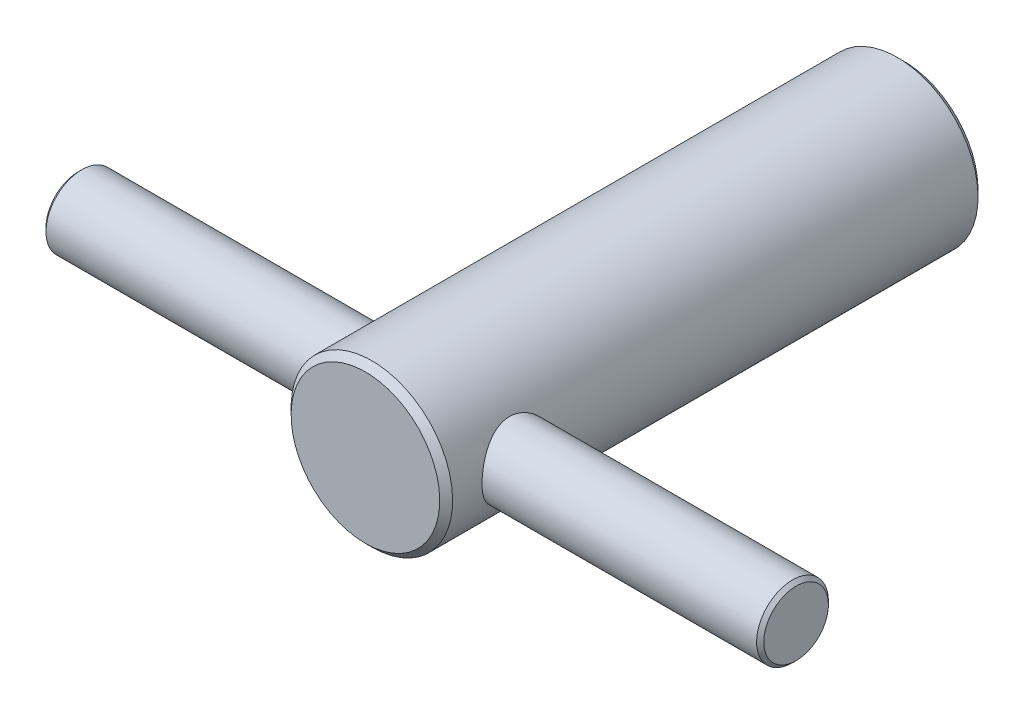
ISO-10303-21;
HEADER;
FILE_DESCRIPTION(('STEP AP214'),'2;1');
FILE_NAME('part.step','',(''),(''),'','','');
FILE_SCHEMA(('AUTOMOTIVE_DESIGN { 1 0 10303 214 1 1 1 1 }'));
ENDSEC;
DATA;
#1=APPLICATION_CONTEXT('core data for automotive mechanical design processes');
#2=APPLICATION_PROTOCOL_DEFINITION('international standard','automotive_design',2000,#1);
#3=PRODUCT_CONTEXT('',#1,'mechanical');
#4=PRODUCT('Part','Part','',(#3));
#5=PRODUCT_RELATED_PRODUCT_CATEGORY('part','',(#4));
#6=PRODUCT_DEFINITION_FORMATION('','',#4);
#7=PRODUCT_DEFINITION_CONTEXT('part definition',#1,'design');
#8=PRODUCT_DEFINITION('design','',#6,#7);
#9=PRODUCT_DEFINITION_SHAPE('','',#8);
#10=(LENGTH_UNIT() NAMED_UNIT(*) SI_UNIT(.MILLI.,.METRE.));
#11=(NAMED_UNIT(*) PLANE_ANGLE_UNIT() SI_UNIT($,.RADIAN.));
#12=(NAMED_UNIT(*) SI_UNIT($,.STERADIAN.) SOLID_ANGLE_UNIT());
#13=UNCERTAINTY_MEASURE_WITH_UNIT(LENGTH_MEASURE(1.E-05),#10,'distance_accuracy_value','');
#14=(GEOMETRIC_REPRESENTATION_CONTEXT(3) GLOBAL_UNCERTAINTY_ASSIGNED_CONTEXT((#13)) GLOBAL_UNIT_ASSIGNED_CONTEXT((#10,
#11,#12)) REPRESENTATION_CONTEXT('',''));
#15=CARTESIAN_POINT('',(0.,0.,0.));
#16=DIRECTION('',(0.,0.,1.));
#17=DIRECTION('',(1.,0.,0.));
#18=AXIS2_PLACEMENT_3D('',#15,#16,#17);
#19=CARTESIAN_POINT('',(0.,0.,0.));
#20=DIRECTION('',(0.,0.,-1.));
#21=DIRECTION('',(0.,-1.,0.));
#22=AXIS2_PLACEMENT_3D('',#19,#20,#21);
#23=CYLINDRICAL_SURFACE('',#22,9.);
#24=CARTESIAN_POINT('',(0.,0.,0.72));
#25=DIRECTION('',(0.,0.,-1.));
#26=DIRECTION('',(0.,-1.,0.));
#27=AXIS2_PLACEMENT_3D('',#24,#25,#26);
#28=CIRCLE('',#27,9.);
#29=CARTESIAN_POINT('',(0.,-9.,0.72));
#30=VERTEX_POINT('',#29);
#31=EDGE_CURVE('E87',#30,#30,#28,.T.);
#32=ORIENTED_EDGE('',*,*,#31,.F.);
#33=EDGE_LOOP('',(#32));
#34=FACE_BOUND('',#33,.T.);
#35=CARTESIAN_POINT('',(-8.06225774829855,-4.,52.));
#36=CARTESIAN_POINT('',(-8.06225871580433,-3.99999911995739,52.1059573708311));
#37=CARTESIAN_POINT('',(-8.06435392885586,-3.99578365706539,52.2119439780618));
#38=CARTESIAN_POINT('',(-8.07266315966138,-3.9789689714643,52.4231312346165));
#39=CARTESIAN_POINT('',(-8.07887962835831,-3.96636475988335,52.5283313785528));
#40=CARTESIAN_POINT('',(-8.09523141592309,-3.93288406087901,52.7373178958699));
#41=CARTESIAN_POINT('',(-8.10537442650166,-3.91199133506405,52.8411010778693));
#42=CARTESIAN_POINT('',(-8.12922894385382,-3.8621744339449,53.0463168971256));
#43=CARTESIAN_POINT('',(-8.1429419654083,-3.83324684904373,53.1477485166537));
#44=CARTESIAN_POINT('',(-8.18864631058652,-3.73514516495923,53.4465123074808));
#45=CARTESIAN_POINT('',(-8.2253027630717,-3.6544602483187,53.6394881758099));
#46=CARTESIAN_POINT('',(-8.30683459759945,-3.46512080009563,54.0090136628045));
#47=CARTESIAN_POINT('',(-8.35170881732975,-3.35647022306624,54.1855655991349));
#48=CARTESIAN_POINT('',(-8.44818605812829,-3.10600597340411,54.530001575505));
#49=CARTESIAN_POINT('',(-8.50003637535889,-2.96250577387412,54.6965928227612));
#50=CARTESIAN_POINT('',(-8.60260345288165,-2.64995455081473,55.0043096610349));
#51=CARTESIAN_POINT('',(-8.65331973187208,-2.48089290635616,55.1454246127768));
#52=CARTESIAN_POINT('',(-8.75098098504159,-2.11153557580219,55.4051265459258));
#53=CARTESIAN_POINT('',(-8.79760568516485,-1.9100929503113,55.522213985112));
#54=CARTESIAN_POINT('',(-8.87874924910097,-1.48791769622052,55.7202665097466));
#55=CARTESIAN_POINT('',(-8.91327418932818,-1.26719481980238,55.8012497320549));
#56=CARTESIAN_POINT('',(-8.96456719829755,-0.826358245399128,55.9199692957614));
#57=CARTESIAN_POINT('',(-8.98225241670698,-0.606957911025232,55.9599498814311));
#58=CARTESIAN_POINT('',(-9.00123386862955,-0.163899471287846,56.0028246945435));
#59=CARTESIAN_POINT('',(-9.00253773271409,0.0597566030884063,56.0057361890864));
#60=CARTESIAN_POINT('',(-8.9891172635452,0.488489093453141,55.9754702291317));
#61=CARTESIAN_POINT('',(-8.97549378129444,0.693781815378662,55.9447715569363));
#62=CARTESIAN_POINT('',(-8.93530946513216,1.09594639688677,55.8524633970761));
#63=CARTESIAN_POINT('',(-8.90874767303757,1.2928176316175,55.7908516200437));
#64=CARTESIAN_POINT('',(-8.84470124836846,1.67619924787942,55.6378056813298));
#65=CARTESIAN_POINT('',(-8.80705628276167,1.86250594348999,55.5459312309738));
#66=CARTESIAN_POINT('',(-8.72443358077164,2.21755082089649,55.3354303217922));
#67=CARTESIAN_POINT('',(-8.67945317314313,2.38628256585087,55.2167941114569));
#68=CARTESIAN_POINT('',(-8.58241773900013,2.7154801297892,54.945371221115));
#69=CARTESIAN_POINT('',(-8.53008453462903,2.8742540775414,54.790633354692));
#70=CARTESIAN_POINT('',(-8.42674548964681,3.16444740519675,54.4566596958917));
#71=CARTESIAN_POINT('',(-8.37574032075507,3.29585316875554,54.2774117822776));
#72=CARTESIAN_POINT('',(-8.30349353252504,3.47221412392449,53.9892620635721));
#73=CARTESIAN_POINT('',(-8.27968910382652,3.52844732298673,53.8877448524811));
#74=CARTESIAN_POINT('',(-8.23475847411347,3.63207089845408,53.6797442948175));
#75=CARTESIAN_POINT('',(-8.2136310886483,3.67946519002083,53.5732631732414));
#76=CARTESIAN_POINT('',(-8.17480574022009,3.76493796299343,53.3560476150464));
#77=CARTESIAN_POINT('',(-8.15710705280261,3.80301841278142,53.245314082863));
#78=CARTESIAN_POINT('',(-8.12581877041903,3.86942100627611,53.0204470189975));
#79=CARTESIAN_POINT('',(-8.11222690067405,3.89774855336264,52.9063154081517));
#80=CARTESIAN_POINT('',(-8.09048889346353,3.94265987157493,52.6836732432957));
#81=CARTESIAN_POINT('',(-8.08202710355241,3.95992921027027,52.5753315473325));
#82=CARTESIAN_POINT('',(-8.06944257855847,3.9855114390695,52.3573918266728));
#83=CARTESIAN_POINT('',(-8.06531779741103,3.99382855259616,52.2477944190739));
#84=CARTESIAN_POINT('',(-8.06156002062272,4.00140826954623,52.0282276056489));
#85=CARTESIAN_POINT('',(-8.06192629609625,4.00067234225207,51.918258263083));
#86=CARTESIAN_POINT('',(-8.06713428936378,3.99016019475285,51.6988639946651));
#87=CARTESIAN_POINT('',(-8.07197583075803,3.98038433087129,51.5894390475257));
#88=CARTESIAN_POINT('',(-8.08540695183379,3.95302498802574,51.3804691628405));
#89=CARTESIAN_POINT('',(-8.09367676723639,3.9361057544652,51.2808160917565));
#90=CARTESIAN_POINT('',(-8.11360050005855,3.89486887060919,51.0833855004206));
#91=CARTESIAN_POINT('',(-8.12525556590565,3.87054870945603,50.9856086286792));
#92=CARTESIAN_POINT('',(-8.16479240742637,3.78682316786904,50.6960590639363));
#93=CARTESIAN_POINT('',(-8.19725658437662,3.71663214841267,50.5079130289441));
#94=CARTESIAN_POINT('',(-8.27248834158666,3.54611617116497,50.1376014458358));
#95=CARTESIAN_POINT('',(-8.31565196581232,3.44458335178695,49.956080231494));
#96=CARTESIAN_POINT('',(-8.40692978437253,3.21539109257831,49.6116810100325));
#97=CARTESIAN_POINT('',(-8.45504630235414,3.08771936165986,49.4488118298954));
#98=CARTESIAN_POINT('',(-8.55631670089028,2.79562298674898,49.1302412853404));
#99=CARTESIAN_POINT('',(-8.6095148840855,2.62885906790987,48.9766907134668));
#100=CARTESIAN_POINT('',(-8.71080374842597,2.2707901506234,48.6992727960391));
#101=CARTESIAN_POINT('',(-8.75889370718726,2.07948168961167,48.5754096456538));
#102=CARTESIAN_POINT('',(-8.84519710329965,1.67498083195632,48.3603130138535));
#103=CARTESIAN_POINT('',(-8.88332261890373,1.46161537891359,48.269367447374));
#104=CARTESIAN_POINT('',(-8.94472578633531,1.02045840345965,48.1254165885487));
#105=CARTESIAN_POINT('',(-8.96801362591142,0.792676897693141,48.0723852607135));
#106=CARTESIAN_POINT('',(-8.99580137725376,0.348228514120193,48.0093663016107));
#107=CARTESIAN_POINT('',(-9.00161841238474,0.132069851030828,47.99635916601));
#108=CARTESIAN_POINT('',(-8.99760436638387,-0.299340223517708,48.0053897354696));
#109=CARTESIAN_POINT('',(-8.98777674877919,-0.514591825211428,48.0274196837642));
#110=CARTESIAN_POINT('',(-8.954312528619,-0.928153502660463,48.1037447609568));
#111=CARTESIAN_POINT('',(-8.93130800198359,-1.12679150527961,48.1565648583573));
#112=CARTESIAN_POINT('',(-8.87418367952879,-1.51223596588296,48.2912477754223));
#113=CARTESIAN_POINT('',(-8.84006193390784,-1.69904034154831,48.3731156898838));
#114=CARTESIAN_POINT('',(-8.76198674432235,-2.06499399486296,48.5676964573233));
#115=CARTESIAN_POINT('',(-8.71765436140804,-2.24339999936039,48.6816510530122));
#116=CARTESIAN_POINT('',(-8.62423537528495,-2.57934407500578,48.9354703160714));
#117=CARTESIAN_POINT('',(-8.5751467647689,-2.73687326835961,49.0753459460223));
#118=CARTESIAN_POINT('',(-8.47281938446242,-3.03954409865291,49.3899201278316));
#119=CARTESIAN_POINT('',(-8.41955831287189,-3.18273227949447,49.5664938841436));
#120=CARTESIAN_POINT('',(-8.31863267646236,-3.43791440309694,49.942733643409));
#121=CARTESIAN_POINT('',(-8.27097161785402,-3.5498888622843,50.1424139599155));
#122=CARTESIAN_POINT('',(-8.20816019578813,-3.69171847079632,50.4558196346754));
#123=CARTESIAN_POINT('',(-8.18863116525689,-3.73471557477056,50.5628930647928));
#124=CARTESIAN_POINT('',(-8.15320381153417,-3.81143772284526,50.780874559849));
#125=CARTESIAN_POINT('',(-8.13730367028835,-3.84516741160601,50.8917806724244));
#126=CARTESIAN_POINT('',(-8.10978099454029,-3.90288007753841,51.1162955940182));
#127=CARTESIAN_POINT('',(-8.09814723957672,-3.92688863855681,51.2298964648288));
#128=CARTESIAN_POINT('',(-8.07957808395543,-3.96495546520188,51.4590746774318));
#129=CARTESIAN_POINT('',(-8.07263915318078,-3.97902120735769,51.5746504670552));
#130=CARTESIAN_POINT('',(-8.06621715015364,-3.99201145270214,51.7421042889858));
#131=CARTESIAN_POINT('',(-8.06473388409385,-3.99500589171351,51.7936230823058));
#132=CARTESIAN_POINT('',(-8.06275393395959,-3.999000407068,51.896758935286));
#133=CARTESIAN_POINT('',(-8.06225727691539,-4.00000042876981,51.9483759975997));
#134=CARTESIAN_POINT('',(-8.06225774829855,-4.,52.));
#135=B_SPLINE_CURVE_WITH_KNOTS('',3,(#35,#36,#37,#38,#39,#40,#41,#42,#43,#44,#45,#46,#47,#48,
#49,#50,#51,#52,#53,#54,#55,#56,#57,#58,#59,#60,#61,#62,#63,#64,#65,#66,#67,#68,#69,#70,#71,#72,
#73,#74,#75,#76,#77,#78,#79,#80,#81,#82,#83,#84,#85,#86,#87,#88,#89,#90,#91,#92,#93,#94,#95,#96,
#97,#98,#99,#100,#101,#102,#103,#104,#105,#106,#107,#108,#109,#110,#111,#112,#113,#114,#115,
#116,#117,#118,#119,#120,#121,#122,#123,#124,#125,#126,#127,#128,#129,#130,#131,#132,#133,#134),
.UNSPECIFIED.,.T.,.F.,(4,2,2,2,2,2,2,2,2,2,2,2,2,2,2,2,2,2,2,2,2,2,2,2,2,2,2,2,2,2,2,2,2,2,2,2,
2,2,2,2,2,2,2,2,2,2,2,2,2,4),(0.,0.317818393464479,0.635825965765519,0.954459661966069,
1.27322877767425,1.9072287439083,2.54113910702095,3.21592082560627,3.89098369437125,
4.60017396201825,5.30900756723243,5.97655382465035,6.64378912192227,7.26493832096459,
7.88613352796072,8.51679809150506,9.14769283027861,9.82817138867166,10.5089876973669,
10.8640051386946,11.2188649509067,11.573649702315,11.9282375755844,12.2578989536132,
12.5874047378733,12.9168570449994,13.2462963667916,13.5501886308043,13.8541841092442,
14.4617122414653,15.0964254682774,15.7314378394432,16.4267756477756,17.1222116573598,
17.8235911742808,18.5244885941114,19.1710234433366,19.8174151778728,20.435125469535,
21.0529441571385,21.6990794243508,22.3454885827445,23.0428199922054,23.7405857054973,
24.0912600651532,24.4417583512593,24.7913281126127,25.1406347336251,25.2954763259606,
25.4503221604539),.UNSPECIFIED.);
#136=CARTESIAN_POINT('',(-8.06225774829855,-4.,52.));
#137=VERTEX_POINT('',#136);
#138=EDGE_CURVE('E27',#137,#137,#135,.T.);
#139=ORIENTED_EDGE('',*,*,#138,.F.);
#140=EDGE_LOOP('',(#139));
#141=FACE_BOUND('',#140,.T.);
#142=CARTESIAN_POINT('',(0.,0.,59.28));
#143=DIRECTION('',(0.,0.,-1.));
#144=DIRECTION('',(0.,-1.,0.));
#145=AXIS2_PLACEMENT_3D('',#142,#143,#144);
#146=CIRCLE('',#145,9.);
#147=CARTESIAN_POINT('',(0.,-9.,59.28));
#148=VERTEX_POINT('',#147);
#149=EDGE_CURVE('E94',#148,#148,#146,.T.);
#150=ORIENTED_EDGE('',*,*,#149,.T.);
#151=EDGE_LOOP('',(#150));
#152=FACE_BOUND('',#151,.T.);
#153=CARTESIAN_POINT('',(8.06225774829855,-4.,52.));
#154=CARTESIAN_POINT('',(8.06225871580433,-3.99999911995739,51.8940426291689));
#155=CARTESIAN_POINT('',(8.06435392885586,-3.99578365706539,51.7880560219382));
#156=CARTESIAN_POINT('',(8.07266315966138,-3.9789689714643,51.5768687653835));
#157=CARTESIAN_POINT('',(8.07887962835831,-3.96636475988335,51.4716686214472));
#158=CARTESIAN_POINT('',(8.09523141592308,-3.93288406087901,51.2626821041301));
#159=CARTESIAN_POINT('',(8.10537442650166,-3.91199133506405,51.1588989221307));
#160=CARTESIAN_POINT('',(8.12922894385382,-3.86217443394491,50.9536831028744));
#161=CARTESIAN_POINT('',(8.1429419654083,-3.83324684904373,50.8522514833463));
#162=CARTESIAN_POINT('',(8.18864631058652,-3.73514516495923,50.5534876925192));
#163=CARTESIAN_POINT('',(8.2253027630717,-3.6544602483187,50.3605118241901));
#164=CARTESIAN_POINT('',(8.30683459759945,-3.46512080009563,49.9909863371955));
#165=CARTESIAN_POINT('',(8.35170881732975,-3.35647022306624,49.8144344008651));
#166=CARTESIAN_POINT('',(8.44818605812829,-3.1060059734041,49.469998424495));
#167=CARTESIAN_POINT('',(8.50003637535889,-2.96250577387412,49.3034071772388));
#168=CARTESIAN_POINT('',(8.60260345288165,-2.64995455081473,48.9956903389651));
#169=CARTESIAN_POINT('',(8.65331973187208,-2.48089290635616,48.8545753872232));
#170=CARTESIAN_POINT('',(8.75098098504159,-2.11153557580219,48.5948734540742));
#171=CARTESIAN_POINT('',(8.79760568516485,-1.9100929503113,48.477786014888));
#172=CARTESIAN_POINT('',(8.87874924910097,-1.48791769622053,48.2797334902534));
#173=CARTESIAN_POINT('',(8.91327418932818,-1.26719481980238,48.1987502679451));
#174=CARTESIAN_POINT('',(8.96456719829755,-0.826358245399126,48.0800307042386));
#175=CARTESIAN_POINT('',(8.98225241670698,-0.606957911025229,48.0400501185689));
#176=CARTESIAN_POINT('',(9.00123386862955,-0.163899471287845,47.9971753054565));
#177=CARTESIAN_POINT('',(9.00253773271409,0.0597566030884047,47.9942638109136));
#178=CARTESIAN_POINT('',(8.98911726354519,0.488489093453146,48.0245297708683));
#179=CARTESIAN_POINT('',(8.97549378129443,0.693781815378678,48.0552284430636));
#180=CARTESIAN_POINT('',(8.93530946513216,1.09594639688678,48.1475366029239));
#181=CARTESIAN_POINT('',(8.90874767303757,1.29281763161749,48.2091483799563));
#182=CARTESIAN_POINT('',(8.84470124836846,1.67619924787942,48.3621943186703));
#183=CARTESIAN_POINT('',(8.80705628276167,1.86250594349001,48.4540687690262));
#184=CARTESIAN_POINT('',(8.72443358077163,2.21755082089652,48.6645696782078));
#185=CARTESIAN_POINT('',(8.67945317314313,2.38628256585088,48.7832058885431));
#186=CARTESIAN_POINT('',(8.58241773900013,2.7154801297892,49.054628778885));
#187=CARTESIAN_POINT('',(8.53008453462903,2.8742540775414,49.209366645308));
#188=CARTESIAN_POINT('',(8.42674548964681,3.16444740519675,49.5433403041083));
#189=CARTESIAN_POINT('',(8.37574032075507,3.29585316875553,49.7225882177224));
#190=CARTESIAN_POINT('',(8.30349353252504,3.47221412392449,50.0107379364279));
#191=CARTESIAN_POINT('',(8.27968910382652,3.52844732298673,50.1122551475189));
#192=CARTESIAN_POINT('',(8.23475847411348,3.63207089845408,50.3202557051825));
#193=CARTESIAN_POINT('',(8.2136310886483,3.67946519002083,50.4267368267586));
#194=CARTESIAN_POINT('',(8.17480574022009,3.76493796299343,50.6439523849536));
#195=CARTESIAN_POINT('',(8.15710705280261,3.80301841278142,50.754685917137));
#196=CARTESIAN_POINT('',(8.12581877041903,3.86942100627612,50.9795529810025));
#197=CARTESIAN_POINT('',(8.11222690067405,3.89774855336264,51.0936845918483));
#198=CARTESIAN_POINT('',(8.09048889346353,3.94265987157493,51.3163267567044));
#199=CARTESIAN_POINT('',(8.08202710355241,3.95992921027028,51.4246684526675));
#200=CARTESIAN_POINT('',(8.06944257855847,3.9855114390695,51.6426081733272));
#201=CARTESIAN_POINT('',(8.06531779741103,3.99382855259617,51.7522055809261));
#202=CARTESIAN_POINT('',(8.06156002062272,4.00140826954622,51.9717723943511));
#203=CARTESIAN_POINT('',(8.06192629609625,4.00067234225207,52.081741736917));
#204=CARTESIAN_POINT('',(8.06713428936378,3.99016019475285,52.3011360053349));
#205=CARTESIAN_POINT('',(8.07197583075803,3.98038433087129,52.4105609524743));
#206=CARTESIAN_POINT('',(8.08540695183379,3.95302498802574,52.6195308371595));
#207=CARTESIAN_POINT('',(8.09367676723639,3.9361057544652,52.7191839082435));
#208=CARTESIAN_POINT('',(8.11360050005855,3.89486887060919,52.9166144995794));
#209=CARTESIAN_POINT('',(8.12525556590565,3.87054870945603,53.0143913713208));
#210=CARTESIAN_POINT('',(8.16479240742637,3.78682316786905,53.3039409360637));
#211=CARTESIAN_POINT('',(8.19725658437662,3.71663214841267,53.4920869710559));
#212=CARTESIAN_POINT('',(8.27248834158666,3.54611617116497,53.8623985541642));
#213=CARTESIAN_POINT('',(8.31565196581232,3.44458335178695,54.043919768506));
#214=CARTESIAN_POINT('',(8.40692978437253,3.21539109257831,54.3883189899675));
#215=CARTESIAN_POINT('',(8.45504630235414,3.08771936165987,54.5511881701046));
#216=CARTESIAN_POINT('',(8.55631670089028,2.79562298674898,54.8697587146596));
#217=CARTESIAN_POINT('',(8.6095148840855,2.62885906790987,55.0233092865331));
#218=CARTESIAN_POINT('',(8.71080374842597,2.2707901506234,55.3007272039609));
#219=CARTESIAN_POINT('',(8.75889370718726,2.07948168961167,55.4245903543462));
#220=CARTESIAN_POINT('',(8.84519710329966,1.67498083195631,55.6396869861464));
#221=CARTESIAN_POINT('',(8.88332261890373,1.46161537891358,55.730632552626));
#222=CARTESIAN_POINT('',(8.94472578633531,1.02045840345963,55.8745834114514));
#223=CARTESIAN_POINT('',(8.96801362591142,0.79267689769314,55.9276147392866));
#224=CARTESIAN_POINT('',(8.99580137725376,0.348228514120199,55.9906336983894));
#225=CARTESIAN_POINT('',(9.00161841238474,0.13206985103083,56.00364083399));
#226=CARTESIAN_POINT('',(8.99760436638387,-0.29934022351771,55.9946102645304));
#227=CARTESIAN_POINT('',(8.98777674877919,-0.514591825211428,55.9725803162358));
#228=CARTESIAN_POINT('',(8.954312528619,-0.928153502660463,55.8962552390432));
#229=CARTESIAN_POINT('',(8.93130800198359,-1.12679150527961,55.8434351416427));
#230=CARTESIAN_POINT('',(8.87418367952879,-1.51223596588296,55.7087522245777));
#231=CARTESIAN_POINT('',(8.84006193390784,-1.69904034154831,55.6268843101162));
#232=CARTESIAN_POINT('',(8.76198674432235,-2.06499399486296,55.4323035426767));
#233=CARTESIAN_POINT('',(8.71765436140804,-2.24339999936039,55.3183489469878));
#234=CARTESIAN_POINT('',(8.62423537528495,-2.57934407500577,55.0645296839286));
#235=CARTESIAN_POINT('',(8.5751467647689,-2.73687326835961,54.9246540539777));
#236=CARTESIAN_POINT('',(8.47281938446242,-3.03954409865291,54.6100798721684));
#237=CARTESIAN_POINT('',(8.41955831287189,-3.18273227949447,54.4335061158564));
#238=CARTESIAN_POINT('',(8.31863267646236,-3.43791440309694,54.057266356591));
#239=CARTESIAN_POINT('',(8.27097161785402,-3.5498888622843,53.8575860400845));
#240=CARTESIAN_POINT('',(8.20816019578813,-3.69171847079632,53.5441803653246));
#241=CARTESIAN_POINT('',(8.18863116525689,-3.73471557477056,53.4371069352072));
#242=CARTESIAN_POINT('',(8.15320381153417,-3.81143772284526,53.219125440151));
#243=CARTESIAN_POINT('',(8.13730367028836,-3.84516741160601,53.1082193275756));
#244=CARTESIAN_POINT('',(8.10978099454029,-3.90288007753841,52.8837044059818));
#245=CARTESIAN_POINT('',(8.09814723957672,-3.92688863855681,52.7701035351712));
#246=CARTESIAN_POINT('',(8.07957808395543,-3.96495546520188,52.5409253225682));
#247=CARTESIAN_POINT('',(8.07263915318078,-3.97902120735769,52.4253495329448));
#248=CARTESIAN_POINT('',(8.06621715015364,-3.99201145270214,52.2578957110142));
#249=CARTESIAN_POINT('',(8.06473388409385,-3.99500589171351,52.2063769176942));
#250=CARTESIAN_POINT('',(8.06275393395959,-3.999000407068,52.103241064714));
#251=CARTESIAN_POINT('',(8.06225727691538,-4.00000042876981,52.0516240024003));
#252=CARTESIAN_POINT('',(8.06225774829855,-4.,52.));
#253=B_SPLINE_CURVE_WITH_KNOTS('',3,(#153,#154,#155,#156,#157,#158,#159,#160,#161,#162,#163,
#164,#165,#166,#167,#168,#169,#170,#171,#172,#173,#174,#175,#176,#177,#178,#179,#180,#181,#182,
#183,#184,#185,#186,#187,#188,#189,#190,#191,#192,#193,#194,#195,#196,#197,#198,#199,#200,#201,
#202,#203,#204,#205,#206,#207,#208,#209,#210,#211,#212,#213,#214,#215,#216,#217,#218,#219,#220,
#221,#222,#223,#224,#225,#226,#227,#228,#229,#230,#231,#232,#233,#234,#235,#236,#237,#238,#239,
#240,#241,#242,#243,#244,#245,#246,#247,#248,#249,#250,#251,#252),.UNSPECIFIED.,.T.,.F.,(4,2,2,
2,2,2,2,2,2,2,2,2,2,2,2,2,2,2,2,2,2,2,2,2,2,2,2,2,2,2,2,2,2,2,2,2,2,2,2,2,2,2,2,2,2,2,2,2,2,4),
(0.,0.317818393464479,0.635825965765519,0.954459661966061,1.27322877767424,1.90722874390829,
2.54113910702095,3.21592082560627,3.89098369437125,4.60017396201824,5.30900756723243,
5.97655382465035,6.64378912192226,7.2649383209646,7.88613352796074,8.51679809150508,
9.1476928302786,9.82817138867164,10.5089876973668,10.8640051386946,11.2188649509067,
11.573649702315,11.9282375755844,12.2578989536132,12.5874047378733,12.9168570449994,
13.2462963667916,13.5501886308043,13.8541841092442,14.4617122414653,15.0964254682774,
15.7314378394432,16.4267756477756,17.1222116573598,17.8235911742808,18.5244885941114,
19.1710234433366,19.8174151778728,20.435125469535,21.0529441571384,21.6990794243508,
22.3454885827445,23.0428199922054,23.7405857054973,24.0912600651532,24.4417583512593,
24.7913281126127,25.1406347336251,25.2954763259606,25.4503221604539),.UNSPECIFIED.);
#254=CARTESIAN_POINT('',(8.06225774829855,-4.,52.));
#255=VERTEX_POINT('',#254);
#256=EDGE_CURVE('E23',#255,#255,#253,.T.);
#257=ORIENTED_EDGE('',*,*,#256,.F.);
#258=EDGE_LOOP('',(#257));
#259=FACE_BOUND('',#258,.T.);
#260=ADVANCED_FACE('F12',(#34,#141,#152,#259),#23,.T.);
#261=CARTESIAN_POINT('',(-8.28,0.,0.));
#262=DIRECTION('',(0.,0.,1.));
#263=DIRECTION('',(0.,1.,0.));
#264=AXIS2_PLACEMENT_3D('',#261,#262,#263);
#265=PLANE('',#264);
#266=CARTESIAN_POINT('',(0.,0.,0.));
#267=DIRECTION('',(0.,0.,1.));
#268=DIRECTION('',(0.,1.,0.));
#269=AXIS2_PLACEMENT_3D('',#266,#267,#268);
#270=CIRCLE('',#269,5.65);
#271=CARTESIAN_POINT('',(0.,5.65,0.));
#272=VERTEX_POINT('',#271);
#273=EDGE_CURVE('E8',#272,#272,#270,.T.);
#274=ORIENTED_EDGE('',*,*,#273,.T.);
#275=EDGE_LOOP('',(#274));
#276=FACE_BOUND('',#275,.T.);
#277=CARTESIAN_POINT('',(0.,0.,0.));
#278=DIRECTION('',(0.,0.,-1.));
#279=DIRECTION('',(0.,-1.,0.));
#280=AXIS2_PLACEMENT_3D('',#277,#278,#279);
#281=CIRCLE('',#280,8.28);
#282=CARTESIAN_POINT('',(0.,-8.28,0.));
#283=VERTEX_POINT('',#282);
#284=EDGE_CURVE('E104',#283,#283,#281,.T.);
#285=ORIENTED_EDGE('',*,*,#284,.T.);
#286=EDGE_LOOP('',(#285));
#287=FACE_BOUND('',#286,.T.);
#288=ADVANCED_FACE('F61',(#276,#287),#265,.F.);
#289=CARTESIAN_POINT('',(0.,0.,60.));
#290=DIRECTION('',(0.,0.,-1.));
#291=DIRECTION('',(0.,-1.,0.));
#292=AXIS2_PLACEMENT_3D('',#289,#290,#291);
#293=PLANE('',#292);
#294=CARTESIAN_POINT('',(0.,0.,60.));
#295=DIRECTION('',(0.,0.,-1.));
#296=DIRECTION('',(0.,-1.,0.));
#297=AXIS2_PLACEMENT_3D('',#294,#295,#296);
#298=CIRCLE('',#297,8.28);
#299=CARTESIAN_POINT('',(0.,-8.28,60.));
#300=VERTEX_POINT('',#299);
#301=EDGE_CURVE('E114',#300,#300,#298,.T.);
#302=ORIENTED_EDGE('',*,*,#301,.F.);
#303=EDGE_LOOP('',(#302));
#304=FACE_BOUND('',#303,.T.);
#305=ADVANCED_FACE('F63',(#304),#293,.F.);
#306=CARTESIAN_POINT('',(0.,0.,60.));
#307=DIRECTION('',(0.,0.,-1.));
#308=DIRECTION('',(0.,-1.,0.));
#309=AXIS2_PLACEMENT_3D('',#306,#307,#308);
#310=CONICAL_SURFACE('',#309,8.28,0.78539816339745);
#311=ORIENTED_EDGE('',*,*,#149,.F.);
#312=EDGE_LOOP('',(#311));
#313=FACE_BOUND('',#312,.T.);
#314=ORIENTED_EDGE('',*,*,#301,.T.);
#315=EDGE_LOOP('',(#314));
#316=FACE_BOUND('',#315,.T.);
#317=ADVANCED_FACE('F67',(#313,#316),#310,.T.);
#318=CARTESIAN_POINT('',(0.,0.,0.72));
#319=DIRECTION('',(0.,0.,1.));
#320=DIRECTION('',(0.,1.,0.));
#321=AXIS2_PLACEMENT_3D('',#318,#319,#320);
#322=CONICAL_SURFACE('',#321,9.,0.78539816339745);
#323=ORIENTED_EDGE('',*,*,#284,.F.);
#324=EDGE_LOOP('',(#323));
#325=FACE_BOUND('',#324,.T.);
#326=ORIENTED_EDGE('',*,*,#31,.T.);
#327=EDGE_LOOP('',(#326));
#328=FACE_BOUND('',#327,.T.);
#329=ADVANCED_FACE('F64',(#325,#328),#322,.T.);
#330=CARTESIAN_POINT('',(-40.,0.,55.6));
#331=DIRECTION('',(1.,0.,0.));
#332=DIRECTION('',(0.,1.,0.));
#333=AXIS2_PLACEMENT_3D('',#330,#331,#332);
#334=PLANE('',#333);
#335=CARTESIAN_POINT('',(-40.,0.,52.));
#336=DIRECTION('',(-1.,0.,0.));
#337=DIRECTION('',(0.,-1.,0.));
#338=AXIS2_PLACEMENT_3D('',#335,#336,#337);
#339=CIRCLE('',#338,3.6);
#340=CARTESIAN_POINT('',(-40.,-3.6,52.));
#341=VERTEX_POINT('',#340);
#342=EDGE_CURVE('E107',#341,#341,#339,.T.);
#343=ORIENTED_EDGE('',*,*,#342,.T.);
#344=EDGE_LOOP('',(#343));
#345=FACE_BOUND('',#344,.T.);
#346=ADVANCED_FACE('F66',(#345),#334,.F.);
#347=CARTESIAN_POINT('',(-39.6,0.,52.));
#348=DIRECTION('',(1.,0.,0.));
#349=DIRECTION('',(0.,1.,0.));
#350=AXIS2_PLACEMENT_3D('',#347,#348,#349);
#351=CONICAL_SURFACE('',#350,4.,0.785398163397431);
#352=ORIENTED_EDGE('',*,*,#342,.F.);
#353=EDGE_LOOP('',(#352));
#354=FACE_BOUND('',#353,.T.);
#355=CARTESIAN_POINT('',(-39.6,0.,52.));
#356=DIRECTION('',(-1.,0.,0.));
#357=DIRECTION('',(0.,-1.,0.));
#358=AXIS2_PLACEMENT_3D('',#355,#356,#357);
#359=CIRCLE('',#358,4.);
#360=CARTESIAN_POINT('',(-39.6,-4.,52.));
#361=VERTEX_POINT('',#360);
#362=EDGE_CURVE('E101',#361,#361,#359,.T.);
#363=ORIENTED_EDGE('',*,*,#362,.T.);
#364=EDGE_LOOP('',(#363));
#365=FACE_BOUND('',#364,.T.);
#366=ADVANCED_FACE('F50',(#354,#365),#351,.T.);
#367=CARTESIAN_POINT('',(-40.,0.,52.));
#368=DIRECTION('',(-1.,0.,0.));
#369=DIRECTION('',(0.,-1.,0.));
#370=AXIS2_PLACEMENT_3D('',#367,#368,#369);
#371=CYLINDRICAL_SURFACE('',#370,4.);
#372=ORIENTED_EDGE('',*,*,#362,.F.);
#373=EDGE_LOOP('',(#372));
#374=FACE_BOUND('',#373,.T.);
#375=ORIENTED_EDGE('',*,*,#138,.T.);
#376=EDGE_LOOP('',(#375));
#377=FACE_BOUND('',#376,.T.);
#378=ADVANCED_FACE('F48',(#374,#377),#371,.T.);
#379=ORIENTED_EDGE('',*,*,#256,.T.);
#380=EDGE_LOOP('',(#379));
#381=FACE_BOUND('',#380,.T.);
#382=CARTESIAN_POINT('',(39.6,0.,52.));
#383=DIRECTION('',(-1.,0.,0.));
#384=DIRECTION('',(0.,-1.,0.));
#385=AXIS2_PLACEMENT_3D('',#382,#383,#384);
#386=CIRCLE('',#385,4.);
#387=CARTESIAN_POINT('',(39.6,-4.,52.));
#388=VERTEX_POINT('',#387);
#389=EDGE_CURVE('E99',#388,#388,#386,.T.);
#390=ORIENTED_EDGE('',*,*,#389,.T.);
#391=EDGE_LOOP('',(#390));
#392=FACE_BOUND('',#391,.T.);
#393=ADVANCED_FACE('F42',(#381,#392),#371,.T.);
#394=CARTESIAN_POINT('',(40.,0.,52.));
#395=DIRECTION('',(-1.,0.,0.));
#396=DIRECTION('',(0.,-1.,0.));
#397=AXIS2_PLACEMENT_3D('',#394,#395,#396);
#398=PLANE('',#397);
#399=CARTESIAN_POINT('',(40.,0.,52.));
#400=DIRECTION('',(-1.,0.,0.));
#401=DIRECTION('',(0.,-1.,0.));
#402=AXIS2_PLACEMENT_3D('',#399,#400,#401);
#403=CIRCLE('',#402,3.6);
#404=CARTESIAN_POINT('',(40.,-3.6,52.));
#405=VERTEX_POINT('',#404);
#406=EDGE_CURVE('E100',#405,#405,#403,.T.);
#407=ORIENTED_EDGE('',*,*,#406,.F.);
#408=EDGE_LOOP('',(#407));
#409=FACE_BOUND('',#408,.T.);
#410=ADVANCED_FACE('F47',(#409),#398,.F.);
#411=CARTESIAN_POINT('',(40.,0.,52.));
#412=DIRECTION('',(-1.,0.,0.));
#413=DIRECTION('',(0.,-1.,0.));
#414=AXIS2_PLACEMENT_3D('',#411,#412,#413);
#415=CONICAL_SURFACE('',#414,3.6,0.785398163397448);
#416=ORIENTED_EDGE('',*,*,#389,.F.);
#417=EDGE_LOOP('',(#416));
#418=FACE_BOUND('',#417,.T.);
#419=ORIENTED_EDGE('',*,*,#406,.T.);
#420=EDGE_LOOP('',(#419));
#421=FACE_BOUND('',#420,.T.);
#422=ADVANCED_FACE('F52',(#418,#421),#415,.T.);
#423=CARTESIAN_POINT('',(0.,0.,20.));
#424=DIRECTION('',(0.,0.,-1.));
#425=DIRECTION('',(0.,-1.,0.));
#426=AXIS2_PLACEMENT_3D('',#423,#424,#425);
#427=CYLINDRICAL_SURFACE('',#426,5.);
#428=CARTESIAN_POINT('',(0.,0.,0.649999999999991));
#429=DIRECTION('',(0.,0.,1.));
#430=DIRECTION('',(0.,1.,0.));
#431=AXIS2_PLACEMENT_3D('',#428,#429,#430);
#432=CIRCLE('',#431,5.);
#433=CARTESIAN_POINT('',(0.,5.,0.649999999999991));
#434=VERTEX_POINT('',#433);
#435=EDGE_CURVE('E19',#434,#434,#432,.F.);
#436=ORIENTED_EDGE('',*,*,#435,.T.);
#437=EDGE_LOOP('',(#436));
#438=FACE_BOUND('',#437,.T.);
#439=CARTESIAN_POINT('',(0.,0.,20.));
#440=DIRECTION('',(0.,0.,-1.));
#441=DIRECTION('',(0.,-1.,0.));
#442=AXIS2_PLACEMENT_3D('',#439,#440,#441);
#443=CIRCLE('',#442,5.);
#444=CARTESIAN_POINT('',(0.,-5.,20.));
#445=VERTEX_POINT('',#444);
#446=EDGE_CURVE('E133',#445,#445,#443,.T.);
#447=ORIENTED_EDGE('',*,*,#446,.F.);
#448=EDGE_LOOP('',(#447));
#449=FACE_BOUND('',#448,.T.);
#450=ADVANCED_FACE('F56',(#438,#449),#427,.F.);
#451=CARTESIAN_POINT('',(0.,0.,20.));
#452=DIRECTION('',(0.,0.,-1.));
#453=DIRECTION('',(0.,-1.,0.));
#454=AXIS2_PLACEMENT_3D('',#451,#452,#453);
#455=PLANE('',#454);
#456=ORIENTED_EDGE('',*,*,#446,.T.);
#457=EDGE_LOOP('',(#456));
#458=FACE_BOUND('',#457,.T.);
#459=ADVANCED_FACE('F138',(#458),#455,.T.);
#460=CARTESIAN_POINT('',(0.,0.,0.649999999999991));
#461=DIRECTION('',(0.,0.,-1.));
#462=DIRECTION('',(0.,-1.,0.));
#463=AXIS2_PLACEMENT_3D('',#460,#461,#462);
#464=CONICAL_SURFACE('',#463,5.,0.785398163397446);
#465=ORIENTED_EDGE('',*,*,#273,.F.);
#466=EDGE_LOOP('',(#465));
#467=FACE_BOUND('',#466,.T.);
#468=ORIENTED_EDGE('',*,*,#435,.F.);
#469=EDGE_LOOP('',(#468));
#470=FACE_BOUND('',#469,.T.);
#471=ADVANCED_FACE('F14',(#467,#470),#464,.F.);
#472=CLOSED_SHELL('',(#260,#288,#305,#317,#329,#346,#366,#378,#393,#410,#422,#450,#459,#471));
#473=MANIFOLD_SOLID_BREP('B1',#472);
#474=ADVANCED_BREP_SHAPE_REPRESENTATION('',(#18,#473),#14);
#475=SHAPE_DEFINITION_REPRESENTATION(#9,#474);
ENDSEC;
END-ISO-10303-21;
